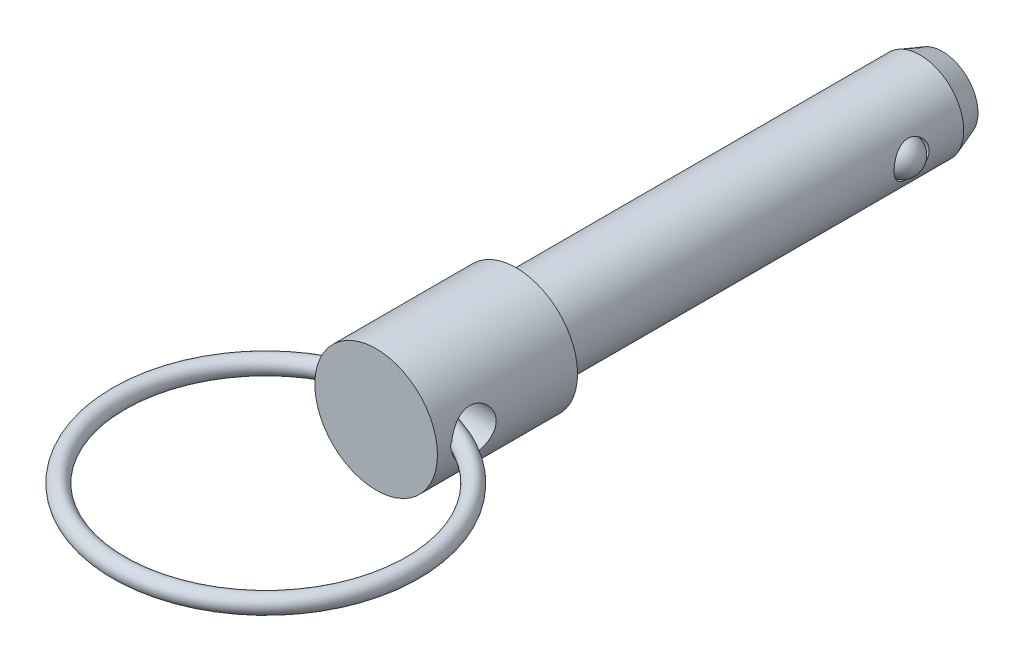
ISO-10303-21;
HEADER;
FILE_DESCRIPTION(('STEP AP214'),'2;1');
FILE_NAME('part.step','',(''),(''),'','','');
FILE_SCHEMA(('AUTOMOTIVE_DESIGN { 1 0 10303 214 1 1 1 1 }'));
ENDSEC;
DATA;
#1=APPLICATION_CONTEXT('core data for automotive mechanical design processes');
#2=APPLICATION_PROTOCOL_DEFINITION('international standard','automotive_design',2000,#1);
#3=PRODUCT_CONTEXT('',#1,'mechanical');
#4=PRODUCT('Part','Part','',(#3));
#5=PRODUCT_RELATED_PRODUCT_CATEGORY('part','',(#4));
#6=PRODUCT_DEFINITION_FORMATION('','',#4);
#7=PRODUCT_DEFINITION_CONTEXT('part definition',#1,'design');
#8=PRODUCT_DEFINITION('design','',#6,#7);
#9=PRODUCT_DEFINITION_SHAPE('','',#8);
#10=(LENGTH_UNIT() NAMED_UNIT(*) SI_UNIT(.MILLI.,.METRE.));
#11=(NAMED_UNIT(*) PLANE_ANGLE_UNIT() SI_UNIT($,.RADIAN.));
#12=(NAMED_UNIT(*) SI_UNIT($,.STERADIAN.) SOLID_ANGLE_UNIT());
#13=UNCERTAINTY_MEASURE_WITH_UNIT(LENGTH_MEASURE(1.E-05),#10,'distance_accuracy_value','');
#14=(GEOMETRIC_REPRESENTATION_CONTEXT(3) GLOBAL_UNCERTAINTY_ASSIGNED_CONTEXT((#13)) GLOBAL_UNIT_ASSIGNED_CONTEXT((#10,
#11,#12)) REPRESENTATION_CONTEXT('',''));
#15=CARTESIAN_POINT('',(0.,0.,0.));
#16=DIRECTION('',(0.,0.,1.));
#17=DIRECTION('',(1.,0.,0.));
#18=AXIS2_PLACEMENT_3D('',#15,#16,#17);
#19=CARTESIAN_POINT('',(7.9375,0.,9.398));
#20=DIRECTION('',(-1.,0.,0.));
#21=DIRECTION('',(0.,0.,-1.));
#22=AXIS2_PLACEMENT_3D('',#19,#20,#21);
#23=CYLINDRICAL_SURFACE('',#22,2.0193);
#24=CARTESIAN_POINT('',(-5.55645,0.413388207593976,11.3745329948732));
#25=CARTESIAN_POINT('',(-5.53323669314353,0.388835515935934,11.3796705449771));
#26=CARTESIAN_POINT('',(-5.51157389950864,0.362641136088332,11.3846690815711));
#27=CARTESIAN_POINT('',(-5.47216390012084,0.307044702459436,11.3940198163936));
#28=CARTESIAN_POINT('',(-5.45444977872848,0.277618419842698,11.3983664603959));
#29=CARTESIAN_POINT('',(-5.42406600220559,0.215851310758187,11.4059720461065));
#30=CARTESIAN_POINT('',(-5.41142802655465,0.183493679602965,11.4092241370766));
#31=CARTESIAN_POINT('',(-5.3923512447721,0.116986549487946,11.4141821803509));
#32=CARTESIAN_POINT('',(-5.38588919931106,0.0828442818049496,11.4158939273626));
#33=CARTESIAN_POINT('',(-5.37995615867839,0.0172985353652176,11.4174656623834));
#34=CARTESIAN_POINT('',(-5.37986165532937,-0.0140451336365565,11.4174908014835));
#35=CARTESIAN_POINT('',(-5.38511249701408,-0.0762532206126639,11.4160995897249));
#36=CARTESIAN_POINT('',(-5.39046041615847,-0.107117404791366,11.4146825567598));
#37=CARTESIAN_POINT('',(-5.40574321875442,-0.165640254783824,11.4106965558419));
#38=CARTESIAN_POINT('',(-5.41539031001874,-0.193380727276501,11.408200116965));
#39=CARTESIAN_POINT('',(-5.43862859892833,-0.247073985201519,11.4023097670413));
#40=CARTESIAN_POINT('',(-5.45222392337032,-0.273024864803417,11.398914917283));
#41=CARTESIAN_POINT('',(-5.48024922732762,-0.318737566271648,11.3920973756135));
#42=CARTESIAN_POINT('',(-5.49418727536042,-0.338820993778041,11.3887682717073));
#43=CARTESIAN_POINT('',(-5.523970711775,-0.377330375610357,11.3818282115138));
#44=CARTESIAN_POINT('',(-5.53980753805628,-0.395763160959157,11.378218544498));
#45=CARTESIAN_POINT('',(-5.55645,-0.413388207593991,11.3745329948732));
#46=B_SPLINE_CURVE_WITH_KNOTS('',3,(#24,#25,#26,#27,#28,#29,#30,#31,#32,#33,#34,#35,#36,#37,#38,
#39,#40,#41,#42,#43,#44,#45),.UNSPECIFIED.,.F.,.F.,(4,2,2,2,2,2,2,2,2,2,4),(0.,
0.102621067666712,0.20607208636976,0.310159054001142,0.413852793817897,0.507376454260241,
0.600944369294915,0.689017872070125,0.777183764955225,0.851068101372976,0.924630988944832),.UNSPECIFIED.);
#47=CARTESIAN_POINT('',(-5.54200209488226,0.397651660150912,11.3777589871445));
#48=VERTEX_POINT('',#47);
#49=CARTESIAN_POINT('',(-5.54200209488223,-0.39765166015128,11.3777589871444));
#50=VERTEX_POINT('',#49);
#51=EDGE_CURVE('E40',#48,#50,#46,.T.);
#52=ORIENTED_EDGE('',*,*,#51,.F.);
#53=CARTESIAN_POINT('',(-5.55625,0.,11.4173));
#54=CARTESIAN_POINT('',(-5.55624527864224,-0.109432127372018,11.4172937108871));
#55=CARTESIAN_POINT('',(-5.55298237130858,-0.218969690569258,11.408361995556));
#56=CARTESIAN_POINT('',(-5.54026368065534,-0.434902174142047,11.372953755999));
#57=CARTESIAN_POINT('',(-5.53079819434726,-0.54129189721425,11.3464497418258));
#58=CARTESIAN_POINT('',(-5.50670156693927,-0.74760504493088,11.2769560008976));
#59=CARTESIAN_POINT('',(-5.49208344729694,-0.847544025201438,11.2340078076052));
#60=CARTESIAN_POINT('',(-5.45915039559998,-1.03875753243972,11.1330083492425));
#61=CARTESIAN_POINT('',(-5.44083572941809,-1.13003268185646,11.0749581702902));
#62=CARTESIAN_POINT('',(-5.40158114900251,-1.30505728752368,10.9429422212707));
#63=CARTESIAN_POINT('',(-5.38056990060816,-1.38841141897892,10.8684736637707));
#64=CARTESIAN_POINT('',(-5.33865236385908,-1.54176439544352,10.7067995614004));
#65=CARTESIAN_POINT('',(-5.31774611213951,-1.61175885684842,10.6195898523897));
#66=CARTESIAN_POINT('',(-5.27759352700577,-1.73882919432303,10.4311528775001));
#67=CARTESIAN_POINT('',(-5.25843183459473,-1.79536185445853,10.3295394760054));
#68=CARTESIAN_POINT('',(-5.22503611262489,-1.89036141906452,10.1174402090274));
#69=CARTESIAN_POINT('',(-5.21080023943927,-1.92883508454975,10.0069576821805));
#70=CARTESIAN_POINT('',(-5.18962447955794,-1.98509166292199,9.78477737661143));
#71=CARTESIAN_POINT('',(-5.18242178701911,-2.00362275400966,9.67329490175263));
#72=CARTESIAN_POINT('',(-5.17535625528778,-2.02180769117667,9.44858805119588));
#73=CARTESIAN_POINT('',(-5.17549061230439,-2.02146874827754,9.33536435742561));
#74=CARTESIAN_POINT('',(-5.18285629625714,-2.00249790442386,9.11709454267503));
#75=CARTESIAN_POINT('',(-5.18969215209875,-1.98488533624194,9.01194405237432));
#76=CARTESIAN_POINT('',(-5.2090363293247,-1.93354575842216,8.80620743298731));
#77=CARTESIAN_POINT('',(-5.22154547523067,-1.89981640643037,8.70562196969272));
#78=CARTESIAN_POINT('',(-5.25107746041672,-1.81661001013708,8.50972358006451));
#79=CARTESIAN_POINT('',(-5.26817827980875,-1.76685762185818,8.41453987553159));
#80=CARTESIAN_POINT('',(-5.30493780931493,-1.65321144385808,8.23357336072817));
#81=CARTESIAN_POINT('',(-5.32459724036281,-1.58931366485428,8.14779321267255));
#82=CARTESIAN_POINT('',(-5.36576425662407,-1.44447059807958,7.9824072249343));
#83=CARTESIAN_POINT('',(-5.3873104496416,-1.36270785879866,7.90352531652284));
#84=CARTESIAN_POINT('',(-5.42876622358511,-1.18682967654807,7.76035905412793));
#85=CARTESIAN_POINT('',(-5.44867505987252,-1.09270866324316,7.69608131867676));
#86=CARTESIAN_POINT('',(-5.48497084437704,-0.893001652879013,7.58320896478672));
#87=CARTESIAN_POINT('',(-5.50130295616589,-0.787270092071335,7.53485348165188));
#88=CARTESIAN_POINT('',(-5.52817729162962,-0.568540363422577,7.45692936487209));
#89=CARTESIAN_POINT('',(-5.53873126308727,-0.455557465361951,7.4273225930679));
#90=CARTESIAN_POINT('',(-5.54924569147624,-0.284581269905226,7.39803699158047));
#91=CARTESIAN_POINT('',(-5.5518636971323,-0.227949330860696,7.3907957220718));
#92=CARTESIAN_POINT('',(-5.55536708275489,-0.114221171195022,7.3811255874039));
#93=CARTESIAN_POINT('',(-5.55625246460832,-0.0571249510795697,7.37869671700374));
#94=CARTESIAN_POINT('',(-5.55624527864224,0.109432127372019,7.37870628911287));
#95=CARTESIAN_POINT('',(-5.55298237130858,0.218969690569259,7.38763800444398));
#96=CARTESIAN_POINT('',(-5.54026368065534,0.434902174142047,7.42304624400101));
#97=CARTESIAN_POINT('',(-5.53079819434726,0.54129189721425,7.44955025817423));
#98=CARTESIAN_POINT('',(-5.50670156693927,0.747605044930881,7.51904399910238));
#99=CARTESIAN_POINT('',(-5.49208344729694,0.847544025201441,7.56199219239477));
#100=CARTESIAN_POINT('',(-5.45915039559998,1.03875753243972,7.66299165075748));
#101=CARTESIAN_POINT('',(-5.44083572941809,1.13003268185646,7.7210418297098));
#102=CARTESIAN_POINT('',(-5.40158114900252,1.30505728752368,7.85305777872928));
#103=CARTESIAN_POINT('',(-5.38056990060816,1.38841141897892,7.92752633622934));
#104=CARTESIAN_POINT('',(-5.33865236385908,1.54176439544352,8.08920043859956));
#105=CARTESIAN_POINT('',(-5.31774611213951,1.61175885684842,8.17641014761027));
#106=CARTESIAN_POINT('',(-5.27759352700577,1.73882919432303,8.36484712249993));
#107=CARTESIAN_POINT('',(-5.25843183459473,1.79536185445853,8.46646052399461));
#108=CARTESIAN_POINT('',(-5.22503611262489,1.89036141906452,8.67855979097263));
#109=CARTESIAN_POINT('',(-5.21080023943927,1.92883508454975,8.78904231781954));
#110=CARTESIAN_POINT('',(-5.18962447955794,1.98509166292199,9.01122262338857));
#111=CARTESIAN_POINT('',(-5.18242178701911,2.00362275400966,9.12270509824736));
#112=CARTESIAN_POINT('',(-5.17535625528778,2.02180769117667,9.34741194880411));
#113=CARTESIAN_POINT('',(-5.17549061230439,2.02146874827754,9.46063564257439));
#114=CARTESIAN_POINT('',(-5.18285629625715,2.00249790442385,9.67890545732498));
#115=CARTESIAN_POINT('',(-5.18969215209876,1.98488533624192,9.78405594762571));
#116=CARTESIAN_POINT('',(-5.20903632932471,1.93354575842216,9.98979256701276));
#117=CARTESIAN_POINT('',(-5.22154547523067,1.89981640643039,10.0903780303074));
#118=CARTESIAN_POINT('',(-5.25107746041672,1.81661001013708,10.2862764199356));
#119=CARTESIAN_POINT('',(-5.26817827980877,1.76685762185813,10.3814601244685));
#120=CARTESIAN_POINT('',(-5.30493780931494,1.65321144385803,10.5624266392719));
#121=CARTESIAN_POINT('',(-5.32459724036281,1.58931366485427,10.6482067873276));
#122=CARTESIAN_POINT('',(-5.36576425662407,1.44447059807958,10.8135927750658));
#123=CARTESIAN_POINT('',(-5.38731044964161,1.36270785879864,10.8924746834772));
#124=CARTESIAN_POINT('',(-5.42876622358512,1.18682967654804,11.0356409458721));
#125=CARTESIAN_POINT('',(-5.44867505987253,1.09270866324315,11.0999186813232));
#126=CARTESIAN_POINT('',(-5.48497084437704,0.893001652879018,11.2127910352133));
#127=CARTESIAN_POINT('',(-5.50130295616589,0.787270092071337,11.2611465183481));
#128=CARTESIAN_POINT('',(-5.52817729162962,0.568540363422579,11.3390706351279));
#129=CARTESIAN_POINT('',(-5.53873126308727,0.455557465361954,11.3686774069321));
#130=CARTESIAN_POINT('',(-5.54924569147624,0.284581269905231,11.3979630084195));
#131=CARTESIAN_POINT('',(-5.55186369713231,0.227949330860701,11.4052042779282));
#132=CARTESIAN_POINT('',(-5.55536708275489,0.114221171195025,11.4148744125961));
#133=CARTESIAN_POINT('',(-5.55625246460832,0.0571249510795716,11.4173032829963));
#134=CARTESIAN_POINT('',(-5.55625,0.,11.4173));
#135=B_SPLINE_CURVE_WITH_KNOTS('',3,(#53,#54,#55,#56,#57,#58,#59,#60,#61,#62,#63,#64,#65,#66,
#67,#68,#69,#70,#71,#72,#73,#74,#75,#76,#77,#78,#79,#80,#81,#82,#83,#84,#85,#86,#87,#88,#89,#90,
#91,#92,#93,#94,#95,#96,#97,#98,#99,#100,#101,#102,#103,#104,#105,#106,#107,#108,#109,#110,#111,
#112,#113,#114,#115,#116,#117,#118,#119,#120,#121,#122,#123,#124,#125,#126,#127,#128,#129,#130,
#131,#132,#133,#134),.UNSPECIFIED.,.T.,.F.,(4,2,2,2,2,2,2,2,2,2,2,2,2,2,2,2,2,2,2,2,2,2,2,2,2,2,
2,2,2,2,2,2,2,2,2,2,2,2,2,2,4),(0.,0.328075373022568,0.656665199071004,0.984430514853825,
1.31217226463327,1.65185430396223,1.99164760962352,2.3434350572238,2.69509069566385,
3.03303658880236,3.37085333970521,3.689865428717,4.00892389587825,4.33378721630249,
4.65874227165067,5.00406386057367,5.3495416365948,5.69999369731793,6.04973056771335,
6.22099023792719,6.39224972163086,6.72032509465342,7.04891492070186,7.37668023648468,
7.70442198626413,8.04410402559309,8.38389733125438,8.73568477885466,9.08734041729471,
9.42528631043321,9.76310306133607,10.0821151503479,10.4011736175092,10.7260369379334,
11.0509919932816,11.3963135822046,11.7417913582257,12.0922434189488,12.4419802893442,
12.6132399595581,12.7844994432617),.UNSPECIFIED.);
#136=EDGE_CURVE('E66',#50,#48,#135,.T.);
#137=ORIENTED_EDGE('',*,*,#136,.F.);
#138=EDGE_LOOP('',(#52,#137));
#139=FACE_BOUND('',#138,.T.);
#140=CARTESIAN_POINT('',(5.55645,-0.41338820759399,11.3745329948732));
#141=CARTESIAN_POINT('',(5.53323669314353,-0.388835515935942,11.3796705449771));
#142=CARTESIAN_POINT('',(5.51157389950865,-0.36264113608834,11.3846690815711));
#143=CARTESIAN_POINT('',(5.47216390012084,-0.307044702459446,11.3940198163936));
#144=CARTESIAN_POINT('',(5.45444977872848,-0.277618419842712,11.3983664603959));
#145=CARTESIAN_POINT('',(5.42406600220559,-0.215851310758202,11.4059720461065));
#146=CARTESIAN_POINT('',(5.41142802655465,-0.183493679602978,11.4092241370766));
#147=CARTESIAN_POINT('',(5.3923512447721,-0.116986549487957,11.4141821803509));
#148=CARTESIAN_POINT('',(5.38588919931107,-0.0828442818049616,11.4158939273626));
#149=CARTESIAN_POINT('',(5.3799561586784,-0.0172985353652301,11.4174656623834));
#150=CARTESIAN_POINT('',(5.37986165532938,0.0140451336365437,11.4174908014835));
#151=CARTESIAN_POINT('',(5.38511249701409,0.0762532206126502,11.4160995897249));
#152=CARTESIAN_POINT('',(5.39046041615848,0.107117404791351,11.4146825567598));
#153=CARTESIAN_POINT('',(5.40574321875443,0.165640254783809,11.4106965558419));
#154=CARTESIAN_POINT('',(5.41539031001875,0.193380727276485,11.408200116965));
#155=CARTESIAN_POINT('',(5.43862859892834,0.247073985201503,11.4023097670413));
#156=CARTESIAN_POINT('',(5.45222392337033,0.273024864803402,11.398914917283));
#157=CARTESIAN_POINT('',(5.48024922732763,0.318737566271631,11.3920973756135));
#158=CARTESIAN_POINT('',(5.49418727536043,0.338820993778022,11.3887682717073));
#159=CARTESIAN_POINT('',(5.523970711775,0.377330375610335,11.3818282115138));
#160=CARTESIAN_POINT('',(5.53980753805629,0.395763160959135,11.378218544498));
#161=CARTESIAN_POINT('',(5.55645,0.413388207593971,11.3745329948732));
#162=B_SPLINE_CURVE_WITH_KNOTS('',3,(#140,#141,#142,#143,#144,#145,#146,#147,#148,#149,#150,
#151,#152,#153,#154,#155,#156,#157,#158,#159,#160,#161),.UNSPECIFIED.,.F.,.F.,(4,2,2,2,2,2,2,2,
2,2,4),(0.,0.102621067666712,0.206072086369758,0.310159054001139,0.413852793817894,
0.507376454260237,0.60094436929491,0.68901787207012,0.77718376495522,0.851068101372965,
0.924630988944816),.UNSPECIFIED.);
#163=CARTESIAN_POINT('',(5.54200209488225,-0.397651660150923,11.3777589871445));
#164=VERTEX_POINT('',#163);
#165=CARTESIAN_POINT('',(5.54200209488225,0.397651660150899,11.3777589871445));
#166=VERTEX_POINT('',#165);
#167=EDGE_CURVE('E33',#164,#166,#162,.T.);
#168=ORIENTED_EDGE('',*,*,#167,.F.);
#169=CARTESIAN_POINT('',(5.55625,0.,7.3787));
#170=CARTESIAN_POINT('',(5.55624527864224,-0.109432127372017,7.37870628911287));
#171=CARTESIAN_POINT('',(5.55298237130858,-0.218969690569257,7.38763800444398));
#172=CARTESIAN_POINT('',(5.54026368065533,-0.434902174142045,7.42304624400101));
#173=CARTESIAN_POINT('',(5.53079819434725,-0.541291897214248,7.44955025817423));
#174=CARTESIAN_POINT('',(5.50670156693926,-0.747605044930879,7.51904399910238));
#175=CARTESIAN_POINT('',(5.49208344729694,-0.847544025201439,7.56199219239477));
#176=CARTESIAN_POINT('',(5.45915039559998,-1.03875753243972,7.66299165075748));
#177=CARTESIAN_POINT('',(5.44083572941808,-1.13003268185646,7.7210418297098));
#178=CARTESIAN_POINT('',(5.4015811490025,-1.30505728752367,7.85305777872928));
#179=CARTESIAN_POINT('',(5.38056990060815,-1.38841141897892,7.92752633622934));
#180=CARTESIAN_POINT('',(5.33865236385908,-1.54176439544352,8.08920043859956));
#181=CARTESIAN_POINT('',(5.31774611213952,-1.61175885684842,8.17641014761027));
#182=CARTESIAN_POINT('',(5.27759352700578,-1.73882919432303,8.36484712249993));
#183=CARTESIAN_POINT('',(5.25843183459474,-1.79536185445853,8.46646052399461));
#184=CARTESIAN_POINT('',(5.22503611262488,-1.89036141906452,8.67855979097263));
#185=CARTESIAN_POINT('',(5.21080023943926,-1.92883508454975,8.78904231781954));
#186=CARTESIAN_POINT('',(5.18962447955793,-1.98509166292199,9.01122262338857));
#187=CARTESIAN_POINT('',(5.18242178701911,-2.00362275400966,9.12270509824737));
#188=CARTESIAN_POINT('',(5.17535625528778,-2.02180769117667,9.34741194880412));
#189=CARTESIAN_POINT('',(5.17549061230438,-2.02146874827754,9.46063564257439));
#190=CARTESIAN_POINT('',(5.18285629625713,-2.00249790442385,9.67890545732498));
#191=CARTESIAN_POINT('',(5.18969215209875,-1.98488533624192,9.78405594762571));
#192=CARTESIAN_POINT('',(5.20903632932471,-1.93354575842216,9.98979256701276));
#193=CARTESIAN_POINT('',(5.22154547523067,-1.89981640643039,10.0903780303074));
#194=CARTESIAN_POINT('',(5.25107746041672,-1.81661001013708,10.2862764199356));
#195=CARTESIAN_POINT('',(5.26817827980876,-1.76685762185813,10.3814601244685));
#196=CARTESIAN_POINT('',(5.30493780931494,-1.65321144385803,10.5624266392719));
#197=CARTESIAN_POINT('',(5.32459724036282,-1.58931366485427,10.6482067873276));
#198=CARTESIAN_POINT('',(5.36576425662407,-1.44447059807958,10.8135927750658));
#199=CARTESIAN_POINT('',(5.38731044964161,-1.36270785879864,10.8924746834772));
#200=CARTESIAN_POINT('',(5.42876622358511,-1.18682967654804,11.0356409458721));
#201=CARTESIAN_POINT('',(5.44867505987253,-1.09270866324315,11.0999186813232));
#202=CARTESIAN_POINT('',(5.48497084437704,-0.893001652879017,11.2127910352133));
#203=CARTESIAN_POINT('',(5.50130295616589,-0.787270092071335,11.2611465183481));
#204=CARTESIAN_POINT('',(5.52817729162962,-0.568540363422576,11.3390706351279));
#205=CARTESIAN_POINT('',(5.53873126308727,-0.455557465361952,11.3686774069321));
#206=CARTESIAN_POINT('',(5.54924569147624,-0.284581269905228,11.3979630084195));
#207=CARTESIAN_POINT('',(5.5518636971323,-0.227949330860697,11.4052042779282));
#208=CARTESIAN_POINT('',(5.55536708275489,-0.114221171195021,11.4148744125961));
#209=CARTESIAN_POINT('',(5.55625246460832,-0.0571249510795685,11.4173032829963));
#210=CARTESIAN_POINT('',(5.55624527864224,0.109432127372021,11.4172937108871));
#211=CARTESIAN_POINT('',(5.55298237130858,0.218969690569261,11.408361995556));
#212=CARTESIAN_POINT('',(5.54026368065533,0.434902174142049,11.372953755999));
#213=CARTESIAN_POINT('',(5.53079819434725,0.541291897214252,11.3464497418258));
#214=CARTESIAN_POINT('',(5.50670156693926,0.747605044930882,11.2769560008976));
#215=CARTESIAN_POINT('',(5.49208344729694,0.847544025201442,11.2340078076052));
#216=CARTESIAN_POINT('',(5.45915039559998,1.03875753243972,11.1330083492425));
#217=CARTESIAN_POINT('',(5.44083572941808,1.13003268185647,11.0749581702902));
#218=CARTESIAN_POINT('',(5.4015811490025,1.30505728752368,10.9429422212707));
#219=CARTESIAN_POINT('',(5.38056990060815,1.38841141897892,10.8684736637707));
#220=CARTESIAN_POINT('',(5.33865236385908,1.54176439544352,10.7067995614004));
#221=CARTESIAN_POINT('',(5.31774611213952,1.61175885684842,10.6195898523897));
#222=CARTESIAN_POINT('',(5.27759352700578,1.73882919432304,10.4311528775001));
#223=CARTESIAN_POINT('',(5.25843183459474,1.79536185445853,10.3295394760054));
#224=CARTESIAN_POINT('',(5.22503611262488,1.89036141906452,10.1174402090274));
#225=CARTESIAN_POINT('',(5.21080023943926,1.92883508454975,10.0069576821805));
#226=CARTESIAN_POINT('',(5.18962447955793,1.98509166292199,9.78477737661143));
#227=CARTESIAN_POINT('',(5.18242178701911,2.00362275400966,9.67329490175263));
#228=CARTESIAN_POINT('',(5.17535625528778,2.02180769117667,9.44858805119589));
#229=CARTESIAN_POINT('',(5.17549061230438,2.02146874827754,9.33536435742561));
#230=CARTESIAN_POINT('',(5.18285629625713,2.00249790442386,9.11709454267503));
#231=CARTESIAN_POINT('',(5.18969215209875,1.98488533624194,9.01194405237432));
#232=CARTESIAN_POINT('',(5.20903632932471,1.93354575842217,8.80620743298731));
#233=CARTESIAN_POINT('',(5.22154547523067,1.89981640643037,8.70562196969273));
#234=CARTESIAN_POINT('',(5.25107746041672,1.81661001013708,8.50972358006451));
#235=CARTESIAN_POINT('',(5.26817827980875,1.76685762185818,8.41453987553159));
#236=CARTESIAN_POINT('',(5.30493780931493,1.65321144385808,8.23357336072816));
#237=CARTESIAN_POINT('',(5.32459724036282,1.58931366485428,8.14779321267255));
#238=CARTESIAN_POINT('',(5.36576425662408,1.44447059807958,7.9824072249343));
#239=CARTESIAN_POINT('',(5.3873104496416,1.36270785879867,7.90352531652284));
#240=CARTESIAN_POINT('',(5.42876622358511,1.18682967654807,7.76035905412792));
#241=CARTESIAN_POINT('',(5.44867505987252,1.09270866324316,7.69608131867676));
#242=CARTESIAN_POINT('',(5.48497084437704,0.893001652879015,7.58320896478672));
#243=CARTESIAN_POINT('',(5.50130295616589,0.787270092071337,7.53485348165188));
#244=CARTESIAN_POINT('',(5.52817729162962,0.568540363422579,7.45692936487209));
#245=CARTESIAN_POINT('',(5.53873126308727,0.455557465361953,7.4273225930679));
#246=CARTESIAN_POINT('',(5.54924569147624,0.284581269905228,7.39803699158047));
#247=CARTESIAN_POINT('',(5.5518636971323,0.227949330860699,7.3907957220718));
#248=CARTESIAN_POINT('',(5.55536708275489,0.114221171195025,7.3811255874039));
#249=CARTESIAN_POINT('',(5.55625246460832,0.0571249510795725,7.37869671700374));
#250=CARTESIAN_POINT('',(5.55625,0.,7.3787));
#251=B_SPLINE_CURVE_WITH_KNOTS('',3,(#169,#170,#171,#172,#173,#174,#175,#176,#177,#178,#179,
#180,#181,#182,#183,#184,#185,#186,#187,#188,#189,#190,#191,#192,#193,#194,#195,#196,#197,#198,
#199,#200,#201,#202,#203,#204,#205,#206,#207,#208,#209,#210,#211,#212,#213,#214,#215,#216,#217,
#218,#219,#220,#221,#222,#223,#224,#225,#226,#227,#228,#229,#230,#231,#232,#233,#234,#235,#236,
#237,#238,#239,#240,#241,#242,#243,#244,#245,#246,#247,#248,#249,#250),.UNSPECIFIED.,.T.,.F.,(4,
2,2,2,2,2,2,2,2,2,2,2,2,2,2,2,2,2,2,2,2,2,2,2,2,2,2,2,2,2,2,2,2,2,2,2,2,2,2,2,4),(0.,
0.328075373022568,0.656665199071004,0.984430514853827,1.31217226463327,1.65185430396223,
1.99164760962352,2.3434350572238,2.69509069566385,3.03303658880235,3.37085333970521,
3.68986542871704,4.00892389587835,4.33378721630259,4.65874227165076,5.00406386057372,
5.34954163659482,5.69999369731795,6.04973056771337,6.2209902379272,6.39224972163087,
6.72032509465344,7.04891492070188,7.3766802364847,7.70442198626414,8.04410402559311,
8.38389733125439,8.73568477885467,9.08734041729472,9.42528631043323,9.76310306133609,
10.0821151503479,10.4011736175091,10.7260369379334,11.0509919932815,11.3963135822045,
11.7417913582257,12.0922434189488,12.4419802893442,12.6132399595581,12.7844994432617),.UNSPECIFIED.);
#252=EDGE_CURVE('E62',#166,#164,#251,.T.);
#253=ORIENTED_EDGE('',*,*,#252,.F.);
#254=EDGE_LOOP('',(#168,#253));
#255=FACE_BOUND('',#254,.T.);
#256=ADVANCED_FACE('F14',(#139,#255),#23,.F.);
#257=CARTESIAN_POINT('',(0.,0.,-28.63596));
#258=DIRECTION('',(0.,0.,-1.));
#259=DIRECTION('',(1.,0.,0.));
#260=AXIS2_PLACEMENT_3D('',#257,#258,#259);
#261=CYLINDRICAL_SURFACE('',#260,5.55625);
#262=ORIENTED_EDGE('',*,*,#252,.T.);
#263=CARTESIAN_POINT('',(5.55009347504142,-0.261488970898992,9.786084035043));
#264=CARTESIAN_POINT('',(5.54812529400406,-0.30325141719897,9.80096224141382));
#265=CARTESIAN_POINT('',(5.5457404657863,-0.343758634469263,9.81942005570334));
#266=CARTESIAN_POINT('',(5.54040847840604,-0.42106674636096,9.86292845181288));
#267=CARTESIAN_POINT('',(5.5374605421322,-0.457862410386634,9.88798816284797));
#268=CARTESIAN_POINT('',(5.53134134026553,-0.526658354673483,9.94386457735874));
#269=CARTESIAN_POINT('',(5.52817046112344,-0.558666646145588,9.97467146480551));
#270=CARTESIAN_POINT('',(5.52194469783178,-0.617178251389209,10.0411137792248));
#271=CARTESIAN_POINT('',(5.51888978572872,-0.643682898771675,10.0767480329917));
#272=CARTESIAN_POINT('',(5.51313628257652,-0.691254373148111,10.1527268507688));
#273=CARTESIAN_POINT('',(5.51044827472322,-0.712171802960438,10.1931655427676));
#274=CARTESIAN_POINT('',(5.50578097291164,-0.747399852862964,10.2768577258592));
#275=CARTESIAN_POINT('',(5.50380188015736,-0.761708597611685,10.3201120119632));
#276=CARTESIAN_POINT('',(5.50062483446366,-0.784334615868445,10.4110491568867));
#277=CARTESIAN_POINT('',(5.4994831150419,-0.79222393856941,10.4588401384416));
#278=CARTESIAN_POINT('',(5.49826873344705,-0.800607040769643,10.5550754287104));
#279=CARTESIAN_POINT('',(5.49819646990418,-0.801098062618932,10.6035199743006));
#280=CARTESIAN_POINT('',(5.49912806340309,-0.794680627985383,10.7039443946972));
#281=CARTESIAN_POINT('',(5.50022168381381,-0.787154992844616,10.7558841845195));
#282=CARTESIAN_POINT('',(5.50347103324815,-0.764103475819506,10.8579332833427));
#283=CARTESIAN_POINT('',(5.5056272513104,-0.748573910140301,10.9080417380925));
#284=CARTESIAN_POINT('',(5.51091051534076,-0.70866781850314,11.0082212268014));
#285=CARTESIAN_POINT('',(5.51408971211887,-0.683800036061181,11.0580951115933));
#286=CARTESIAN_POINT('',(5.5209680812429,-0.625839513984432,11.1528267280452));
#287=CARTESIAN_POINT('',(5.52466742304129,-0.592744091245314,11.197682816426));
#288=CARTESIAN_POINT('',(5.53199718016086,-0.519831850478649,11.279406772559));
#289=CARTESIAN_POINT('',(5.53562669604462,-0.480224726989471,11.3164602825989));
#290=CARTESIAN_POINT('',(5.54239660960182,-0.394450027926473,11.3820559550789));
#291=CARTESIAN_POINT('',(5.5455377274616,-0.348292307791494,11.4106107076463));
#292=CARTESIAN_POINT('',(5.55042537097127,-0.257766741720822,11.4537693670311));
#293=CARTESIAN_POINT('',(5.55230678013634,-0.21407972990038,11.4697807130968));
#294=CARTESIAN_POINT('',(5.55503790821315,-0.124373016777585,11.4927832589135));
#295=CARTESIAN_POINT('',(5.55588906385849,-0.078356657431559,11.4997870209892));
#296=CARTESIAN_POINT('',(5.55638432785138,0.00705853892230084,11.5038718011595));
#297=CARTESIAN_POINT('',(5.55619261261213,0.0463971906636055,11.5023023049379));
#298=CARTESIAN_POINT('',(5.55499790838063,0.124194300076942,11.4923961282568));
#299=CARTESIAN_POINT('',(5.55399500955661,0.162652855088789,11.484060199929));
#300=CARTESIAN_POINT('',(5.55133569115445,0.236455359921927,11.4614747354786));
#301=CARTESIAN_POINT('',(5.54970019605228,0.271858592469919,11.4474138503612));
#302=CARTESIAN_POINT('',(5.54593788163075,0.340082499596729,11.414086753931));
#303=CARTESIAN_POINT('',(5.54381093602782,0.372902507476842,11.394819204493));
#304=CARTESIAN_POINT('',(5.53902830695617,0.438479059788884,11.3497412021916));
#305=CARTESIAN_POINT('',(5.53634134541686,0.470920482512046,11.3234773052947));
#306=CARTESIAN_POINT('',(5.5308403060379,0.53164948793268,11.2665410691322));
#307=CARTESIAN_POINT('',(5.52802616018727,0.559934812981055,11.2358663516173));
#308=CARTESIAN_POINT('',(5.52207389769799,0.616058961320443,11.1660010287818));
#309=CARTESIAN_POINT('',(5.51895184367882,0.643171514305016,11.1262251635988));
#310=CARTESIAN_POINT('',(5.5131400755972,0.691221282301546,11.0430715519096));
#311=CARTESIAN_POINT('',(5.51045062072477,0.712154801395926,10.9996916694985));
#312=CARTESIAN_POINT('',(5.50546631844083,0.749774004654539,10.9047684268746));
#313=CARTESIAN_POINT('',(5.5032620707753,0.765608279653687,10.8528805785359));
#314=CARTESIAN_POINT('',(5.49999925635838,0.788707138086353,10.7471802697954));
#315=CARTESIAN_POINT('',(5.49894104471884,0.795969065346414,10.693367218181));
#316=CARTESIAN_POINT('',(5.49812737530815,0.801573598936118,10.5836973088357));
#317=CARTESIAN_POINT('',(5.49841008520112,0.799654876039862,10.5278260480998));
#318=CARTESIAN_POINT('',(5.50039129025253,0.785912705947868,10.4173293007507));
#319=CARTESIAN_POINT('',(5.50208922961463,0.774093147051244,10.3627033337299));
#320=CARTESIAN_POINT('',(5.50657222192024,0.741502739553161,10.2600057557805));
#321=CARTESIAN_POINT('',(5.50928213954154,0.721341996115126,10.2117380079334));
#322=CARTESIAN_POINT('',(5.5154579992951,0.672487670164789,10.1197820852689));
#323=CARTESIAN_POINT('',(5.51892350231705,0.64379904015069,10.0760912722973));
#324=CARTESIAN_POINT('',(5.52582601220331,0.581424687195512,9.99852087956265));
#325=CARTESIAN_POINT('',(5.52923968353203,0.548383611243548,9.96412004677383));
#326=CARTESIAN_POINT('',(5.53588272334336,0.476663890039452,9.90178589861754));
#327=CARTESIAN_POINT('',(5.53911216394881,0.437987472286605,9.87385003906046));
#328=CARTESIAN_POINT('',(5.54480401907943,0.358545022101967,9.82683552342));
#329=CARTESIAN_POINT('',(5.54729992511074,0.318028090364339,9.80733901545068));
#330=CARTESIAN_POINT('',(5.55147034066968,0.234199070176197,9.7755782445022));
#331=CARTESIAN_POINT('',(5.55314476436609,0.190886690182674,9.76331473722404));
#332=CARTESIAN_POINT('',(5.55544526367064,0.103875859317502,9.74662090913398));
#333=CARTESIAN_POINT('',(5.55609634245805,0.0602137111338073,9.7420036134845));
#334=CARTESIAN_POINT('',(5.55635470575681,-0.0272293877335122,9.74015977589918));
#335=CARTESIAN_POINT('',(5.55596342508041,-0.071010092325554,9.74292307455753));
#336=CARTESIAN_POINT('',(5.55456091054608,-0.139289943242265,9.75303365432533));
#337=CARTESIAN_POINT('',(5.55387840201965,-0.164176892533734,9.75797314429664));
#338=CARTESIAN_POINT('',(5.55220711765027,-0.213342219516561,9.77024669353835));
#339=CARTESIAN_POINT('',(5.5512183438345,-0.237620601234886,9.7775807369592));
#340=CARTESIAN_POINT('',(5.55009347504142,-0.261488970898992,9.786084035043));
#341=B_SPLINE_CURVE_WITH_KNOTS('',3,(#263,#264,#265,#266,#267,#268,#269,#270,#271,#272,#273,
#274,#275,#276,#277,#278,#279,#280,#281,#282,#283,#284,#285,#286,#287,#288,#289,#290,#291,#292,
#293,#294,#295,#296,#297,#298,#299,#300,#301,#302,#303,#304,#305,#306,#307,#308,#309,#310,#311,
#312,#313,#314,#315,#316,#317,#318,#319,#320,#321,#322,#323,#324,#325,#326,#327,#328,#329,#330,
#331,#332,#333,#334,#335,#336,#337,#338,#339,#340),.UNSPECIFIED.,.T.,.F.,(4,2,2,2,2,2,2,2,2,2,2,
2,2,2,2,2,2,2,2,2,2,2,2,2,2,2,2,2,2,2,2,2,2,2,2,2,2,2,4),(0.,0.133035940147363,
0.266256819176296,0.399252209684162,0.532215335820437,0.668441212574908,0.804705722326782,
0.949444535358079,1.09423729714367,1.25104087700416,1.4079166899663,1.57457416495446,
1.74128605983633,1.9034167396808,2.06530602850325,2.20414603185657,2.34279219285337,
2.46030997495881,2.5778146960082,2.69172579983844,2.80566620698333,2.9306617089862,
3.0557248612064,3.19986521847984,3.34409161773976,3.5062449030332,3.66844841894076,
3.83529611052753,4.00207830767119,4.15836501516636,4.31456113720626,4.45728171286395,
4.59994602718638,4.73438372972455,4.8688354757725,4.99994808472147,5.13088030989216,
5.2069144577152,5.28294810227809),.UNSPECIFIED.);
#342=EDGE_CURVE('E27',#164,#166,#341,.T.);
#343=ORIENTED_EDGE('',*,*,#342,.T.);
#344=EDGE_LOOP('',(#262,#343));
#345=FACE_BOUND('',#344,.T.);
#346=CARTESIAN_POINT('',(0.,0.,-8.26977375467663E-11));
#347=DIRECTION('',(0.,0.,-1.));
#348=DIRECTION('',(1.,0.,0.));
#349=AXIS2_PLACEMENT_3D('',#346,#347,#348);
#350=CIRCLE('',#349,5.55625000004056);
#351=CARTESIAN_POINT('',(5.55625000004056,0.,-8.2697982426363E-11));
#352=VERTEX_POINT('',#351);
#353=EDGE_CURVE('E71',#352,#352,#350,.T.);
#354=ORIENTED_EDGE('',*,*,#353,.F.);
#355=EDGE_LOOP('',(#354));
#356=FACE_BOUND('',#355,.T.);
#357=CARTESIAN_POINT('',(0.,0.,12.7000000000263));
#358=DIRECTION('',(0.,0.,-1.));
#359=DIRECTION('',(1.,0.,0.));
#360=AXIS2_PLACEMENT_3D('',#357,#358,#359);
#361=CIRCLE('',#360,5.55625000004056);
#362=CARTESIAN_POINT('',(5.55625000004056,0.,12.7000000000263));
#363=VERTEX_POINT('',#362);
#364=EDGE_CURVE('E279',#363,#363,#361,.T.);
#365=ORIENTED_EDGE('',*,*,#364,.T.);
#366=EDGE_LOOP('',(#365));
#367=FACE_BOUND('',#366,.T.);
#368=ORIENTED_EDGE('',*,*,#136,.T.);
#369=CARTESIAN_POINT('',(-5.55009347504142,-0.261488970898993,9.786084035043));
#370=CARTESIAN_POINT('',(-5.55201952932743,-0.220600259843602,9.77152029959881));
#371=CARTESIAN_POINT('',(-5.55354800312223,-0.178464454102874,9.76037150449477));
#372=CARTESIAN_POINT('',(-5.5556384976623,-0.0928868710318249,9.74524129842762));
#373=CARTESIAN_POINT('',(-5.55620009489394,-0.0494445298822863,9.74126302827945));
#374=CARTESIAN_POINT('',(-5.55629347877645,0.0374935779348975,9.74059719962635));
#375=CARTESIAN_POINT('',(-5.55582538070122,0.0809893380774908,9.74390882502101));
#376=CARTESIAN_POINT('',(-5.55391173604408,0.166795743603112,9.75772411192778));
#377=CARTESIAN_POINT('',(-5.5524662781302,0.209106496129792,9.76822712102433));
#378=CARTESIAN_POINT('',(-5.54875885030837,0.291350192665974,9.79611251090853));
#379=CARTESIAN_POINT('',(-5.54649699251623,0.331283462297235,9.81349394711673));
#380=CARTESIAN_POINT('',(-5.54140563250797,0.407683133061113,9.85461863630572));
#381=CARTESIAN_POINT('',(-5.53857612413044,0.444149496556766,9.87836195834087));
#382=CARTESIAN_POINT('',(-5.53262152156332,0.513054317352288,9.93180289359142));
#383=CARTESIAN_POINT('',(-5.52949345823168,0.54544280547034,9.96156453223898));
#384=CARTESIAN_POINT('',(-5.52330278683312,0.604927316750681,10.0259730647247));
#385=CARTESIAN_POINT('',(-5.52024018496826,0.632022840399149,10.0606204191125));
#386=CARTESIAN_POINT('',(-5.51440051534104,0.681126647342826,10.1349305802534));
#387=CARTESIAN_POINT('',(-5.51163525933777,0.702950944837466,10.1747156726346));
#388=CARTESIAN_POINT('',(-5.50677513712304,0.740062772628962,10.2572565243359));
#389=CARTESIAN_POINT('',(-5.50468043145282,0.75534873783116,10.3000129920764));
#390=CARTESIAN_POINT('',(-5.50124315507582,0.780002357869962,10.3899815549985));
#391=CARTESIAN_POINT('',(-5.49995301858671,0.788961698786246,10.4373072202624));
#392=CARTESIAN_POINT('',(-5.49842553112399,0.799536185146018,10.5327838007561));
#393=CARTESIAN_POINT('',(-5.49818856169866,0.801148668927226,10.580935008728));
#394=CARTESIAN_POINT('',(-5.49877665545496,0.797104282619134,10.6808979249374));
#395=CARTESIAN_POINT('',(-5.49969077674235,0.790837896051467,10.7326845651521));
#396=CARTESIAN_POINT('',(-5.502598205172,0.770345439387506,10.8346351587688));
#397=CARTESIAN_POINT('',(-5.50459199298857,0.756115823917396,10.8847983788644));
#398=CARTESIAN_POINT('',(-5.50958513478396,0.718862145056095,10.9855133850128));
#399=CARTESIAN_POINT('',(-5.51264228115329,0.695318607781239,11.0358713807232));
#400=CARTESIAN_POINT('',(-5.51933971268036,0.639982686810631,11.1318512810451));
#401=CARTESIAN_POINT('',(-5.52298029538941,0.608186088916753,11.177470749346));
#402=CARTESIAN_POINT('',(-5.53030695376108,0.53745681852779,11.2614236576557));
#403=CARTESIAN_POINT('',(-5.53399100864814,0.498663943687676,11.2998741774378));
#404=CARTESIAN_POINT('',(-5.54094301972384,0.414294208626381,11.3684444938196));
#405=CARTESIAN_POINT('',(-5.54421186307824,0.368732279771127,11.3985822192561));
#406=CARTESIAN_POINT('',(-5.54902610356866,0.285409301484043,11.4415518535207));
#407=CARTESIAN_POINT('',(-5.55079831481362,0.248931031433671,11.4568629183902));
#408=CARTESIAN_POINT('',(-5.55365405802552,0.173909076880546,11.4812007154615));
#409=CARTESIAN_POINT('',(-5.55473812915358,0.135367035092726,11.4902323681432));
#410=CARTESIAN_POINT('',(-5.55609389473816,0.0571634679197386,11.5014913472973));
#411=CARTESIAN_POINT('',(-5.55636320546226,0.0174989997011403,11.5036987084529));
#412=CARTESIAN_POINT('',(-5.55604928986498,-0.0615987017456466,11.5011080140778));
#413=CARTESIAN_POINT('',(-5.55546601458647,-0.101031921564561,11.4963095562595));
#414=CARTESIAN_POINT('',(-5.55356355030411,-0.176675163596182,11.4803936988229));
#415=CARTESIAN_POINT('',(-5.55227928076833,-0.212950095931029,11.4695756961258));
#416=CARTESIAN_POINT('',(-5.54913333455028,-0.283330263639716,11.4424161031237));
#417=CARTESIAN_POINT('',(-5.54727154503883,-0.317435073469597,11.4260734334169));
#418=CARTESIAN_POINT('',(-5.54300097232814,-0.385072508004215,11.3872975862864));
#419=CARTESIAN_POINT('',(-5.54056357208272,-0.418407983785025,11.3645254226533));
#420=CARTESIAN_POINT('',(-5.53544762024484,-0.481387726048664,11.3143838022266));
#421=CARTESIAN_POINT('',(-5.53276895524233,-0.511030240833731,11.2870121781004));
#422=CARTESIAN_POINT('',(-5.52699292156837,-0.570330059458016,11.2242365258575));
#423=CARTESIAN_POINT('',(-5.52389129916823,-0.599362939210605,11.1882432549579));
#424=CARTESIAN_POINT('',(-5.51794192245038,-0.651866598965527,11.1123875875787));
#425=CARTESIAN_POINT('',(-5.51509432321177,-0.675333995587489,11.0725228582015));
#426=CARTESIAN_POINT('',(-5.50953849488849,-0.719347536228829,10.9840543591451));
#427=CARTESIAN_POINT('',(-5.50690598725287,-0.739020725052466,10.9350095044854));
#428=CARTESIAN_POINT('',(-5.50259788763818,-0.770442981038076,10.8343900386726));
#429=CARTESIAN_POINT('',(-5.50092272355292,-0.782188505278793,10.782814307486));
#430=CARTESIAN_POINT('',(-5.49868146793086,-0.797800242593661,10.6753545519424));
#431=CARTESIAN_POINT('',(-5.49818587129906,-0.801166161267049,10.6193948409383));
#432=CARTESIAN_POINT('',(-5.49862892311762,-0.798121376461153,10.5077343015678));
#433=CARTESIAN_POINT('',(-5.49956724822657,-0.791712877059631,10.452033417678));
#434=CARTESIAN_POINT('',(-5.5027408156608,-0.769336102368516,10.3451160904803));
#435=CARTESIAN_POINT('',(-5.50491833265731,-0.753792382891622,10.2938098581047));
#436=CARTESIAN_POINT('',(-5.51027934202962,-0.71354413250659,10.1949693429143));
#437=CARTESIAN_POINT('',(-5.51346234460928,-0.688844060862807,10.1474332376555));
#438=CARTESIAN_POINT('',(-5.52010275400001,-0.63331504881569,10.0619154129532));
#439=CARTESIAN_POINT('',(-5.52351228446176,-0.603205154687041,10.0234624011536));
#440=CARTESIAN_POINT('',(-5.53038590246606,-0.536527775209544,9.95266893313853));
#441=CARTESIAN_POINT('',(-5.53384993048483,-0.499966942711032,9.92032224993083));
#442=CARTESIAN_POINT('',(-5.53964550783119,-0.430319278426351,9.86936528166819));
#443=CARTESIAN_POINT('',(-5.54205683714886,-0.398291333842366,9.84930122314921));
#444=CARTESIAN_POINT('',(-5.54644342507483,-0.331652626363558,9.813992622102));
#445=CARTESIAN_POINT('',(-5.54841874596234,-0.297042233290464,9.79874739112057));
#446=CARTESIAN_POINT('',(-5.55009347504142,-0.261488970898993,9.786084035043));
#447=B_SPLINE_CURVE_WITH_KNOTS('',3,(#369,#370,#371,#372,#373,#374,#375,#376,#377,#378,#379,
#380,#381,#382,#383,#384,#385,#386,#387,#388,#389,#390,#391,#392,#393,#394,#395,#396,#397,#398,
#399,#400,#401,#402,#403,#404,#405,#406,#407,#408,#409,#410,#411,#412,#413,#414,#415,#416,#417,
#418,#419,#420,#421,#422,#423,#424,#425,#426,#427,#428,#429,#430,#431,#432,#433,#434,#435,#436,
#437,#438,#439,#440,#441,#442,#443,#444,#445,#446),.UNSPECIFIED.,.T.,.F.,(4,2,2,2,2,2,2,2,2,2,2,
2,2,2,2,2,2,2,2,2,2,2,2,2,2,2,2,2,2,2,2,2,2,2,2,2,2,2,4),(0.,0.13020817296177,0.260473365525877,
0.390723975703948,0.520962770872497,0.651183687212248,0.781406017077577,0.913094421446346,
1.04479524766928,1.18058351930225,1.31640427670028,1.4603424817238,1.60433282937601,
1.76017982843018,1.91609626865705,2.08232629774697,2.24864137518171,2.41194177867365,
2.57488717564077,2.69318920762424,2.811398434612,2.92995317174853,3.0485147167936,
3.1616474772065,3.27480235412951,3.39566347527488,3.51658170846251,3.65508000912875,
3.79366229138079,3.95170470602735,4.10981770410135,4.27716593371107,4.44447643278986,
4.60456550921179,4.76457672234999,4.91068415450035,5.05664177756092,5.16987565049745,
5.28309333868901),.UNSPECIFIED.);
#448=EDGE_CURVE('E9',#48,#50,#447,.T.);
#449=ORIENTED_EDGE('',*,*,#448,.T.);
#450=EDGE_LOOP('',(#368,#449));
#451=FACE_BOUND('',#450,.T.);
#452=ADVANCED_FACE('F64',(#345,#356,#367,#451),#261,.T.);
#453=CARTESIAN_POINT('',(0.,0.,-10.));
#454=DIRECTION('',(0.,0.,1.));
#455=DIRECTION('',(-0.810321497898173,-0.585985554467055,0.));
#456=AXIS2_PLACEMENT_3D('',#453,#454,#455);
#457=CYLINDRICAL_SURFACE('',#456,3.95605);
#458=CARTESIAN_POINT('',(0.,0.,0.));
#459=DIRECTION('',(0.,0.,-1.));
#460=DIRECTION('',(0.810321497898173,0.585985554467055,0.));
#461=AXIS2_PLACEMENT_3D('',#458,#459,#460);
#462=CIRCLE('',#461,3.95605);
#463=CARTESIAN_POINT('',(3.20567236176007,2.31818815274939,0.));
#464=VERTEX_POINT('',#463);
#465=EDGE_CURVE('E60',#464,#464,#462,.T.);
#466=ORIENTED_EDGE('',*,*,#465,.T.);
#467=EDGE_LOOP('',(#466));
#468=FACE_BOUND('',#467,.T.);
#469=CARTESIAN_POINT('',(3.95605,0.,-30.29206));
#470=CARTESIAN_POINT('',(3.95604605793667,0.0853977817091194,-30.2920649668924));
#471=CARTESIAN_POINT('',(3.95325565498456,0.17086984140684,-30.2989843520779));
#472=CARTESIAN_POINT('',(3.9423774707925,0.339330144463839,-30.3263965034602));
#473=CARTESIAN_POINT('',(3.93428211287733,0.422314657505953,-30.3469086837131));
#474=CARTESIAN_POINT('',(3.91366462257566,0.583199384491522,-30.4006392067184));
#475=CARTESIAN_POINT('',(3.90115492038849,0.661113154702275,-30.433821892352));
#476=CARTESIAN_POINT('',(3.87293592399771,0.810225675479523,-30.5117972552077));
#477=CARTESIAN_POINT('',(3.85722666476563,0.881424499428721,-30.5565898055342));
#478=CARTESIAN_POINT('',(3.82336924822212,1.01851810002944,-30.6587424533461));
#479=CARTESIAN_POINT('',(3.80514523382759,1.08405283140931,-30.716560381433));
#480=CARTESIAN_POINT('',(3.76865795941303,1.20479657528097,-30.8421520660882));
#481=CARTESIAN_POINT('',(3.75039468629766,1.26000131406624,-30.9099299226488));
#482=CARTESIAN_POINT('',(3.71498321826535,1.36096514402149,-31.0572149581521));
#483=CARTESIAN_POINT('',(3.69792187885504,1.40618899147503,-31.1371120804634));
#484=CARTESIAN_POINT('',(3.66804079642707,1.4823954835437,-31.3041669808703));
#485=CARTESIAN_POINT('',(3.65521908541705,1.51338473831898,-31.3913213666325));
#486=CARTESIAN_POINT('',(3.63608657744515,1.55877880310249,-31.5662662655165));
#487=CARTESIAN_POINT('',(3.62950564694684,1.57387516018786,-31.6538467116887));
#488=CARTESIAN_POINT('',(3.62281725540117,1.58921493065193,-31.8305259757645));
#489=CARTESIAN_POINT('',(3.62270658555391,1.58946570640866,-31.9196240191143));
#490=CARTESIAN_POINT('',(3.62874096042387,1.5756309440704,-32.0901463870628));
#491=CARTESIAN_POINT('',(3.63444787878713,1.5625494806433,-32.1716706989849));
#492=CARTESIAN_POINT('',(3.65073868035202,1.52409646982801,-32.3312515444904));
#493=CARTESIAN_POINT('',(3.66132342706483,1.49872274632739,-32.4093074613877));
#494=CARTESIAN_POINT('',(3.68641045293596,1.43592091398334,-32.5616270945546));
#495=CARTESIAN_POINT('',(3.70098859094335,1.39825636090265,-32.6357802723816));
#496=CARTESIAN_POINT('',(3.73239843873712,1.31210960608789,-32.7769845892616));
#497=CARTESIAN_POINT('',(3.74923090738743,1.26362375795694,-32.8440333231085));
#498=CARTESIAN_POINT('',(3.78484685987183,1.15278197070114,-32.9746131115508));
#499=CARTESIAN_POINT('',(3.80368030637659,1.08964096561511,-33.0374658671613));
#500=CARTESIAN_POINT('',(3.84007052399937,0.953493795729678,-33.1519268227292));
#501=CARTESIAN_POINT('',(3.85762667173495,0.880482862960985,-33.2035295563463));
#502=CARTESIAN_POINT('',(3.88993279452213,0.724712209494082,-33.2949292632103));
#503=CARTESIAN_POINT('',(3.9046174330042,0.641782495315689,-33.3344608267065));
#504=CARTESIAN_POINT('',(3.92901118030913,0.469788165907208,-33.3987196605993));
#505=CARTESIAN_POINT('',(3.93873025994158,0.380736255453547,-33.4234766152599));
#506=CARTESIAN_POINT('',(3.94891240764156,0.242349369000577,-33.4492066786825));
#507=CARTESIAN_POINT('',(3.95157915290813,0.194170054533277,-33.455890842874));
#508=CARTESIAN_POINT('',(3.95514906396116,0.097335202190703,-33.4648188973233));
#509=CARTESIAN_POINT('',(3.95605224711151,0.0486796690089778,-33.4670628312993));
#510=CARTESIAN_POINT('',(3.95604605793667,-0.0853977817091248,-33.4670550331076));
#511=CARTESIAN_POINT('',(3.95325565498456,-0.170869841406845,-33.4601356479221));
#512=CARTESIAN_POINT('',(3.9423774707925,-0.339330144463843,-33.4327234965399));
#513=CARTESIAN_POINT('',(3.93428211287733,-0.422314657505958,-33.4122113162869));
#514=CARTESIAN_POINT('',(3.91366462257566,-0.583199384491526,-33.3584807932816));
#515=CARTESIAN_POINT('',(3.90115492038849,-0.661113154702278,-33.325298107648));
#516=CARTESIAN_POINT('',(3.87293592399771,-0.810225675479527,-33.2473227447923));
#517=CARTESIAN_POINT('',(3.85722666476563,-0.881424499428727,-33.2025301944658));
#518=CARTESIAN_POINT('',(3.82336924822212,-1.01851810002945,-33.1003775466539));
#519=CARTESIAN_POINT('',(3.80514523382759,-1.08405283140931,-33.042559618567));
#520=CARTESIAN_POINT('',(3.76865795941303,-1.20479657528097,-32.9169679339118));
#521=CARTESIAN_POINT('',(3.75039468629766,-1.26000131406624,-32.8491900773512));
#522=CARTESIAN_POINT('',(3.71498321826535,-1.3609651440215,-32.7019050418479));
#523=CARTESIAN_POINT('',(3.69792187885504,-1.40618899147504,-32.6220079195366));
#524=CARTESIAN_POINT('',(3.66804079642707,-1.48239548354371,-32.4549530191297));
#525=CARTESIAN_POINT('',(3.65521908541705,-1.51338473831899,-32.3677986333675));
#526=CARTESIAN_POINT('',(3.63608657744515,-1.5587788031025,-32.1928537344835));
#527=CARTESIAN_POINT('',(3.62950564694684,-1.57387516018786,-32.1052732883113));
#528=CARTESIAN_POINT('',(3.62281725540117,-1.58921493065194,-31.9285940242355));
#529=CARTESIAN_POINT('',(3.62270658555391,-1.58946570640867,-31.8394959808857));
#530=CARTESIAN_POINT('',(3.62874096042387,-1.57563094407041,-31.6689736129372));
#531=CARTESIAN_POINT('',(3.63444787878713,-1.5625494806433,-31.5874493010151));
#532=CARTESIAN_POINT('',(3.65073868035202,-1.52409646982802,-31.4278684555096));
#533=CARTESIAN_POINT('',(3.66132342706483,-1.4987227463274,-31.3498125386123));
#534=CARTESIAN_POINT('',(3.68641045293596,-1.43592091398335,-31.1974929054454));
#535=CARTESIAN_POINT('',(3.70098859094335,-1.39825636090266,-31.1233397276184));
#536=CARTESIAN_POINT('',(3.73239843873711,-1.3121096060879,-30.9821354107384));
#537=CARTESIAN_POINT('',(3.74923090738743,-1.26362375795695,-30.9150866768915));
#538=CARTESIAN_POINT('',(3.78484685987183,-1.15278197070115,-30.7845068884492));
#539=CARTESIAN_POINT('',(3.80368030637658,-1.08964096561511,-30.7216541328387));
#540=CARTESIAN_POINT('',(3.84007052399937,-0.953493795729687,-30.6071931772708));
#541=CARTESIAN_POINT('',(3.85762667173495,-0.880482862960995,-30.5555904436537));
#542=CARTESIAN_POINT('',(3.88993279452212,-0.724712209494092,-30.4641907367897));
#543=CARTESIAN_POINT('',(3.9046174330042,-0.641782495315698,-30.4246591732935));
#544=CARTESIAN_POINT('',(3.92901118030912,-0.469788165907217,-30.3604003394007));
#545=CARTESIAN_POINT('',(3.93873025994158,-0.380736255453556,-30.3356433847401));
#546=CARTESIAN_POINT('',(3.94891240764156,-0.242349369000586,-30.3099133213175));
#547=CARTESIAN_POINT('',(3.95157915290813,-0.194170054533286,-30.303229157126));
#548=CARTESIAN_POINT('',(3.95514906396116,-0.0973352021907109,-30.2943011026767));
#549=CARTESIAN_POINT('',(3.95605224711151,-0.048679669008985,-30.2920571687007));
#550=CARTESIAN_POINT('',(3.95605,0.,-30.29206));
#551=B_SPLINE_CURVE_WITH_KNOTS('',3,(#469,#470,#471,#472,#473,#474,#475,#476,#477,#478,#479,
#480,#481,#482,#483,#484,#485,#486,#487,#488,#489,#490,#491,#492,#493,#494,#495,#496,#497,#498,
#499,#500,#501,#502,#503,#504,#505,#506,#507,#508,#509,#510,#511,#512,#513,#514,#515,#516,#517,
#518,#519,#520,#521,#522,#523,#524,#525,#526,#527,#528,#529,#530,#531,#532,#533,#534,#535,#536,
#537,#538,#539,#540,#541,#542,#543,#544,#545,#546,#547,#548,#549,#550),.UNSPECIFIED.,.T.,.F.,(4,
2,2,2,2,2,2,2,2,2,2,2,2,2,2,2,2,2,2,2,2,2,2,2,2,2,2,2,2,2,2,2,2,2,2,2,2,2,2,2,4),(0.,
0.256004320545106,0.512375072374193,0.768029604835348,1.02368134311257,1.29033336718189,
1.55709546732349,1.83583223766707,2.11443943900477,2.38034753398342,2.64612375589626,
2.89326290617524,3.14044582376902,3.39269582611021,3.64503095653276,3.91697583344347,
4.18905255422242,4.46674016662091,4.74386797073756,4.88980066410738,5.0357319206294,
5.2917362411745,5.54810699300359,5.80376152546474,6.05941326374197,6.32606528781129,
6.59282738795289,6.87156415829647,7.15017135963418,7.41607945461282,7.68185567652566,
7.92899482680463,8.17617774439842,8.42842774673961,8.68076287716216,8.95270775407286,
9.22478447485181,9.50247208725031,9.77959989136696,9.92553258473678,10.0714638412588),.UNSPECIFIED.);
#552=CARTESIAN_POINT('',(3.95605,0.,-30.29206));
#553=VERTEX_POINT('',#552);
#554=EDGE_CURVE('E132',#553,#553,#551,.T.);
#555=ORIENTED_EDGE('',*,*,#554,.T.);
#556=EDGE_LOOP('',(#555));
#557=FACE_BOUND('',#556,.T.);
#558=CARTESIAN_POINT('',(0.,0.,-36.60396));
#559=DIRECTION('',(0.,0.,-1.));
#560=DIRECTION('',(-1.,0.,0.));
#561=AXIS2_PLACEMENT_3D('',#558,#559,#560);
#562=CIRCLE('',#561,3.95605);
#563=CARTESIAN_POINT('',(-3.95604999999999,0.,-36.60396));
#564=VERTEX_POINT('',#563);
#565=EDGE_CURVE('E117',#564,#564,#562,.F.);
#566=ORIENTED_EDGE('',*,*,#565,.T.);
#567=EDGE_LOOP('',(#566));
#568=FACE_BOUND('',#567,.T.);
#569=CARTESIAN_POINT('',(-3.95605,0.,-33.46706));
#570=CARTESIAN_POINT('',(-3.95604605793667,0.0853977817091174,-33.4670550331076));
#571=CARTESIAN_POINT('',(-3.95325565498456,0.170869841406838,-33.4601356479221));
#572=CARTESIAN_POINT('',(-3.94237747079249,0.339330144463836,-33.4327234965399));
#573=CARTESIAN_POINT('',(-3.93428211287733,0.422314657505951,-33.4122113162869));
#574=CARTESIAN_POINT('',(-3.91366462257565,0.583199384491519,-33.3584807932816));
#575=CARTESIAN_POINT('',(-3.90115492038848,0.661113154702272,-33.325298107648));
#576=CARTESIAN_POINT('',(-3.8729359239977,0.810225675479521,-33.2473227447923));
#577=CARTESIAN_POINT('',(-3.85722666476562,0.88142449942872,-33.2025301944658));
#578=CARTESIAN_POINT('',(-3.82336924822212,1.01851810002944,-33.1003775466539));
#579=CARTESIAN_POINT('',(-3.80514523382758,1.08405283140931,-33.042559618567));
#580=CARTESIAN_POINT('',(-3.76865795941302,1.20479657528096,-32.9169679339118));
#581=CARTESIAN_POINT('',(-3.75039468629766,1.26000131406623,-32.8491900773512));
#582=CARTESIAN_POINT('',(-3.71498321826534,1.36096514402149,-32.7019050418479));
#583=CARTESIAN_POINT('',(-3.69792187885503,1.40618899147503,-32.6220079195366));
#584=CARTESIAN_POINT('',(-3.66804079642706,1.4823954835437,-32.4549530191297));
#585=CARTESIAN_POINT('',(-3.65521908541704,1.51338473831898,-32.3677986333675));
#586=CARTESIAN_POINT('',(-3.63608657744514,1.55877880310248,-32.1928537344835));
#587=CARTESIAN_POINT('',(-3.62950564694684,1.57387516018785,-32.1052732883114));
#588=CARTESIAN_POINT('',(-3.62281725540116,1.58921493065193,-31.9285940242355));
#589=CARTESIAN_POINT('',(-3.6227065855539,1.58946570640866,-31.8394959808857));
#590=CARTESIAN_POINT('',(-3.62874096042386,1.5756309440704,-31.6689736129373));
#591=CARTESIAN_POINT('',(-3.63444787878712,1.5625494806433,-31.5874493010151));
#592=CARTESIAN_POINT('',(-3.65073868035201,1.52409646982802,-31.4278684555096));
#593=CARTESIAN_POINT('',(-3.66132342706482,1.49872274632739,-31.3498125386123));
#594=CARTESIAN_POINT('',(-3.68641045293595,1.43592091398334,-31.1974929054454));
#595=CARTESIAN_POINT('',(-3.70098859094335,1.39825636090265,-31.1233397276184));
#596=CARTESIAN_POINT('',(-3.73239843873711,1.31210960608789,-30.9821354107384));
#597=CARTESIAN_POINT('',(-3.74923090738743,1.26362375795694,-30.9150866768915));
#598=CARTESIAN_POINT('',(-3.78484685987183,1.15278197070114,-30.7845068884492));
#599=CARTESIAN_POINT('',(-3.80368030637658,1.0896409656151,-30.7216541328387));
#600=CARTESIAN_POINT('',(-3.84007052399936,0.953493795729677,-30.6071931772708));
#601=CARTESIAN_POINT('',(-3.85762667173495,0.880482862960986,-30.5555904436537));
#602=CARTESIAN_POINT('',(-3.88993279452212,0.724712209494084,-30.4641907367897));
#603=CARTESIAN_POINT('',(-3.90461743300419,0.64178249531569,-30.4246591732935));
#604=CARTESIAN_POINT('',(-3.92901118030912,0.469788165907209,-30.3604003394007));
#605=CARTESIAN_POINT('',(-3.93873025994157,0.380736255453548,-30.3356433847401));
#606=CARTESIAN_POINT('',(-3.94891240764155,0.242349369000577,-30.3099133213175));
#607=CARTESIAN_POINT('',(-3.95157915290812,0.194170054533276,-30.303229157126));
#608=CARTESIAN_POINT('',(-3.95514906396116,0.0973352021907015,-30.2943011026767));
#609=CARTESIAN_POINT('',(-3.95605224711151,0.0486796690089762,-30.2920571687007));
#610=CARTESIAN_POINT('',(-3.95604605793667,-0.0853977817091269,-30.2920649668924));
#611=CARTESIAN_POINT('',(-3.95325565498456,-0.170869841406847,-30.2989843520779));
#612=CARTESIAN_POINT('',(-3.94237747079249,-0.339330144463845,-30.3263965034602));
#613=CARTESIAN_POINT('',(-3.93428211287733,-0.422314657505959,-30.3469086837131));
#614=CARTESIAN_POINT('',(-3.91366462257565,-0.583199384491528,-30.4006392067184));
#615=CARTESIAN_POINT('',(-3.90115492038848,-0.661113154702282,-30.433821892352));
#616=CARTESIAN_POINT('',(-3.8729359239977,-0.810225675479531,-30.5117972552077));
#617=CARTESIAN_POINT('',(-3.85722666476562,-0.881424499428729,-30.5565898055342));
#618=CARTESIAN_POINT('',(-3.82336924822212,-1.01851810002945,-30.6587424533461));
#619=CARTESIAN_POINT('',(-3.80514523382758,-1.08405283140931,-30.716560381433));
#620=CARTESIAN_POINT('',(-3.76865795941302,-1.20479657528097,-30.8421520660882));
#621=CARTESIAN_POINT('',(-3.75039468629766,-1.26000131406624,-30.9099299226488));
#622=CARTESIAN_POINT('',(-3.71498321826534,-1.3609651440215,-31.0572149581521));
#623=CARTESIAN_POINT('',(-3.69792187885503,-1.40618899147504,-31.1371120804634));
#624=CARTESIAN_POINT('',(-3.66804079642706,-1.48239548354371,-31.3041669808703));
#625=CARTESIAN_POINT('',(-3.65521908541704,-1.51338473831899,-31.3913213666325));
#626=CARTESIAN_POINT('',(-3.63608657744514,-1.5587788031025,-31.5662662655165));
#627=CARTESIAN_POINT('',(-3.62950564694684,-1.57387516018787,-31.6538467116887));
#628=CARTESIAN_POINT('',(-3.62281725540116,-1.58921493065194,-31.8305259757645));
#629=CARTESIAN_POINT('',(-3.6227065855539,-1.58946570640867,-31.9196240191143));
#630=CARTESIAN_POINT('',(-3.62874096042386,-1.57563094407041,-32.0901463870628));
#631=CARTESIAN_POINT('',(-3.63444787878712,-1.56254948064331,-32.1716706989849));
#632=CARTESIAN_POINT('',(-3.65073868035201,-1.52409646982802,-32.3312515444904));
#633=CARTESIAN_POINT('',(-3.66132342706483,-1.4987227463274,-32.4093074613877));
#634=CARTESIAN_POINT('',(-3.68641045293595,-1.43592091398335,-32.5616270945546));
#635=CARTESIAN_POINT('',(-3.70098859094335,-1.39825636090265,-32.6357802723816));
#636=CARTESIAN_POINT('',(-3.73239843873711,-1.3121096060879,-32.7769845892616));
#637=CARTESIAN_POINT('',(-3.74923090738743,-1.26362375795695,-32.8440333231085));
#638=CARTESIAN_POINT('',(-3.78484685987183,-1.15278197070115,-32.9746131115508));
#639=CARTESIAN_POINT('',(-3.80368030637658,-1.08964096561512,-33.0374658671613));
#640=CARTESIAN_POINT('',(-3.84007052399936,-0.953493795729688,-33.1519268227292));
#641=CARTESIAN_POINT('',(-3.85762667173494,-0.880482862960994,-33.2035295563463));
#642=CARTESIAN_POINT('',(-3.88993279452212,-0.724712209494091,-33.2949292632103));
#643=CARTESIAN_POINT('',(-3.90461743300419,-0.641782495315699,-33.3344608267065));
#644=CARTESIAN_POINT('',(-3.92901118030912,-0.469788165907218,-33.3987196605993));
#645=CARTESIAN_POINT('',(-3.93873025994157,-0.380736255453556,-33.4234766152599));
#646=CARTESIAN_POINT('',(-3.94891240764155,-0.242349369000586,-33.4492066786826));
#647=CARTESIAN_POINT('',(-3.95157915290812,-0.194170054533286,-33.455890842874));
#648=CARTESIAN_POINT('',(-3.95514906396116,-0.0973352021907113,-33.4648188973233));
#649=CARTESIAN_POINT('',(-3.95605224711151,-0.0486796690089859,-33.4670628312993));
#650=CARTESIAN_POINT('',(-3.95605,0.,-33.46706));
#651=B_SPLINE_CURVE_WITH_KNOTS('',3,(#569,#570,#571,#572,#573,#574,#575,#576,#577,#578,#579,
#580,#581,#582,#583,#584,#585,#586,#587,#588,#589,#590,#591,#592,#593,#594,#595,#596,#597,#598,
#599,#600,#601,#602,#603,#604,#605,#606,#607,#608,#609,#610,#611,#612,#613,#614,#615,#616,#617,
#618,#619,#620,#621,#622,#623,#624,#625,#626,#627,#628,#629,#630,#631,#632,#633,#634,#635,#636,
#637,#638,#639,#640,#641,#642,#643,#644,#645,#646,#647,#648,#649,#650),.UNSPECIFIED.,.T.,.F.,(4,
2,2,2,2,2,2,2,2,2,2,2,2,2,2,2,2,2,2,2,2,2,2,2,2,2,2,2,2,2,2,2,2,2,2,2,2,2,2,2,4),(0.,
0.256004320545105,0.512375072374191,0.768029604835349,1.02368134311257,1.29033336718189,
1.5570954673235,1.83583223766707,2.11443943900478,2.38034753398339,2.64612375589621,
2.89326290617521,3.14044582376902,3.39269582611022,3.64503095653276,3.91697583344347,
4.18905255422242,4.46674016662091,4.74386797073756,4.88980066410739,5.0357319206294,
5.29173624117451,5.54810699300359,5.80376152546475,6.05941326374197,6.32606528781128,
6.59282738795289,6.87156415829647,7.15017135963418,7.41607945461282,7.68185567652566,
7.92899482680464,8.17617774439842,8.42842774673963,8.68076287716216,8.95270775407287,
9.22478447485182,9.50247208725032,9.77959989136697,9.92553258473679,10.0714638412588),.UNSPECIFIED.);
#652=CARTESIAN_POINT('',(-3.95605,0.,-33.46706));
#653=VERTEX_POINT('',#652);
#654=EDGE_CURVE('E141',#653,#653,#651,.T.);
#655=ORIENTED_EDGE('',*,*,#654,.T.);
#656=EDGE_LOOP('',(#655));
#657=FACE_BOUND('',#656,.T.);
#658=ADVANCED_FACE('F16',(#468,#557,#568,#657),#457,.T.);
#659=CARTESIAN_POINT('',(0.,-5.30225,12.7));
#660=DIRECTION('',(0.,0.,1.));
#661=DIRECTION('',(-1.,0.,0.));
#662=AXIS2_PLACEMENT_3D('',#659,#660,#661);
#663=PLANE('',#662);
#664=ORIENTED_EDGE('',*,*,#364,.F.);
#665=EDGE_LOOP('',(#664));
#666=FACE_BOUND('',#665,.T.);
#667=ADVANCED_FACE('F150',(#666),#663,.T.);
#668=CARTESIAN_POINT('',(0.,-3.95605,0.));
#669=DIRECTION('',(0.,0.,-1.));
#670=DIRECTION('',(1.,0.,0.));
#671=AXIS2_PLACEMENT_3D('',#668,#669,#670);
#672=PLANE('',#671);
#673=ORIENTED_EDGE('',*,*,#353,.T.);
#674=EDGE_LOOP('',(#673));
#675=FACE_BOUND('',#674,.T.);
#676=ORIENTED_EDGE('',*,*,#465,.F.);
#677=EDGE_LOOP('',(#676));
#678=FACE_BOUND('',#677,.T.);
#679=ADVANCED_FACE('F86',(#675,#678),#672,.T.);
#680=CARTESIAN_POINT('',(-3.0861,0.,-31.87956));
#681=DIRECTION('',(0.,0.,-1.));
#682=DIRECTION('',(1.,0.,0.));
#683=AXIS2_PLACEMENT_3D('',#680,#681,#682);
#684=SPHERICAL_SURFACE('',#683,1.5875);
#685=CARTESIAN_POINT('',(-3.0861,0.,-31.87956));
#686=DIRECTION('',(1.,0.,0.));
#687=DIRECTION('',(0.,0.,-1.));
#688=AXIS2_PLACEMENT_3D('',#685,#686,#687);
#689=CIRCLE('',#688,1.5875);
#690=CARTESIAN_POINT('',(-3.0861,0.,-33.46706));
#691=VERTEX_POINT('',#690);
#692=CARTESIAN_POINT('',(-3.0861,0.,-30.29206));
#693=VERTEX_POINT('',#692);
#694=EDGE_CURVE('E112',#691,#693,#689,.F.);
#695=ORIENTED_EDGE('',*,*,#694,.T.);
#696=CARTESIAN_POINT('',(-3.0861,0.,-31.87956));
#697=DIRECTION('',(1.,0.,0.));
#698=DIRECTION('',(0.,0.,-1.));
#699=AXIS2_PLACEMENT_3D('',#696,#697,#698);
#700=CIRCLE('',#699,1.5875);
#701=EDGE_CURVE('E140',#693,#691,#700,.F.);
#702=ORIENTED_EDGE('',*,*,#701,.T.);
#703=EDGE_LOOP('',(#695,#702));
#704=FACE_BOUND('',#703,.T.);
#705=ADVANCED_FACE('F120',(#704),#684,.T.);
#706=CARTESIAN_POINT('',(0.,0.,-38.63596));
#707=DIRECTION('',(0.,0.,-1.));
#708=DIRECTION('',(-1.,0.,0.));
#709=AXIS2_PLACEMENT_3D('',#706,#707,#708);
#710=PLANE('',#709);
#711=CARTESIAN_POINT('',(0.,0.,-38.6359599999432));
#712=DIRECTION('',(0.,0.,1.));
#713=DIRECTION('',(1.,0.,0.));
#714=AXIS2_PLACEMENT_3D('',#711,#712,#713);
#715=CIRCLE('',#714,3.21646248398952);
#716=CARTESIAN_POINT('',(3.21646248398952,0.,-38.6359599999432));
#717=VERTEX_POINT('',#716);
#718=EDGE_CURVE('E146',#717,#717,#715,.T.);
#719=ORIENTED_EDGE('',*,*,#718,.F.);
#720=EDGE_LOOP('',(#719));
#721=FACE_BOUND('',#720,.T.);
#722=ADVANCED_FACE('F123',(#721),#710,.T.);
#723=CARTESIAN_POINT('',(3.0861,0.,-31.87956));
#724=DIRECTION('',(0.,0.,1.));
#725=DIRECTION('',(1.,0.,0.));
#726=AXIS2_PLACEMENT_3D('',#723,#724,#725);
#727=SPHERICAL_SURFACE('',#726,1.5875);
#728=CARTESIAN_POINT('',(3.0861,0.,-31.87956));
#729=DIRECTION('',(1.,0.,0.));
#730=DIRECTION('',(0.,0.,-1.));
#731=AXIS2_PLACEMENT_3D('',#728,#729,#730);
#732=CIRCLE('',#731,1.5875);
#733=CARTESIAN_POINT('',(3.0861,0.,-33.46706));
#734=VERTEX_POINT('',#733);
#735=CARTESIAN_POINT('',(3.0861,0.,-30.29206));
#736=VERTEX_POINT('',#735);
#737=EDGE_CURVE('E255',#734,#736,#732,.T.);
#738=ORIENTED_EDGE('',*,*,#737,.T.);
#739=CARTESIAN_POINT('',(3.0861,0.,-31.87956));
#740=DIRECTION('',(1.,0.,0.));
#741=DIRECTION('',(0.,0.,-1.));
#742=AXIS2_PLACEMENT_3D('',#739,#740,#741);
#743=CIRCLE('',#742,1.5875);
#744=EDGE_CURVE('E257',#736,#734,#743,.T.);
#745=ORIENTED_EDGE('',*,*,#744,.T.);
#746=EDGE_LOOP('',(#738,#745));
#747=FACE_BOUND('',#746,.T.);
#748=ADVANCED_FACE('F97',(#747),#727,.T.);
#749=CARTESIAN_POINT('',(-4.7625,0.,-31.87956));
#750=DIRECTION('',(1.,0.,0.));
#751=DIRECTION('',(0.,0.,-1.));
#752=AXIS2_PLACEMENT_3D('',#749,#750,#751);
#753=CYLINDRICAL_SURFACE('',#752,1.5875);
#754=ORIENTED_EDGE('',*,*,#654,.F.);
#755=EDGE_LOOP('',(#754));
#756=FACE_BOUND('',#755,.T.);
#757=ORIENTED_EDGE('',*,*,#694,.F.);
#758=ORIENTED_EDGE('',*,*,#701,.F.);
#759=EDGE_LOOP('',(#757,#758));
#760=FACE_BOUND('',#759,.T.);
#761=ADVANCED_FACE('F148',(#756,#760),#753,.F.);
#762=CARTESIAN_POINT('',(0.,0.,-36.6039600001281));
#763=DIRECTION('',(0.,0.,1.));
#764=DIRECTION('',(1.,0.,0.));
#765=AXIS2_PLACEMENT_3D('',#762,#763,#764);
#766=CONICAL_SURFACE('',#765,3.95604999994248,0.349065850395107);
#767=ORIENTED_EDGE('',*,*,#565,.F.);
#768=EDGE_LOOP('',(#767));
#769=FACE_BOUND('',#768,.T.);
#770=ORIENTED_EDGE('',*,*,#718,.T.);
#771=EDGE_LOOP('',(#770));
#772=FACE_BOUND('',#771,.T.);
#773=ADVANCED_FACE('F128',(#769,#772),#766,.T.);
#774=CARTESIAN_POINT('',(-4.7625,0.,-31.87956));
#775=DIRECTION('',(1.,0.,0.));
#776=DIRECTION('',(0.,0.,-1.));
#777=AXIS2_PLACEMENT_3D('',#774,#775,#776);
#778=CYLINDRICAL_SURFACE('',#777,1.5875);
#779=ORIENTED_EDGE('',*,*,#737,.F.);
#780=ORIENTED_EDGE('',*,*,#744,.F.);
#781=EDGE_LOOP('',(#779,#780));
#782=FACE_BOUND('',#781,.T.);
#783=ORIENTED_EDGE('',*,*,#554,.F.);
#784=EDGE_LOOP('',(#783));
#785=FACE_BOUND('',#784,.T.);
#786=ADVANCED_FACE('F96',(#782,#785),#778,.F.);
#787=CARTESIAN_POINT('',(0.,0.,22.7000000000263));
#788=DIRECTION('',(0.,1.,0.));
#789=DIRECTION('',(0.,0.,1.));
#790=AXIS2_PLACEMENT_3D('',#787,#788,#789);
#791=TOROIDAL_SURFACE('',#790,13.3,0.8);
#792=ORIENTED_EDGE('',*,*,#342,.F.);
#793=ORIENTED_EDGE('',*,*,#167,.T.);
#794=EDGE_LOOP('',(#792,#793));
#795=FACE_BOUND('',#794,.T.);
#796=ORIENTED_EDGE('',*,*,#448,.F.);
#797=ORIENTED_EDGE('',*,*,#51,.T.);
#798=EDGE_LOOP('',(#796,#797));
#799=FACE_BOUND('',#798,.T.);
#800=ADVANCED_FACE('F56',(#795,#799),#791,.T.);
#801=CLOSED_SHELL('',(#256,#452,#658,#667,#679,#705,#722,#748,#761,#773,#786,#800));
#802=MANIFOLD_SOLID_BREP('B1',#801);
#803=ADVANCED_BREP_SHAPE_REPRESENTATION('',(#18,#802),#14);
#804=SHAPE_DEFINITION_REPRESENTATION(#9,#803);
ENDSEC;
END-ISO-10303-21;
